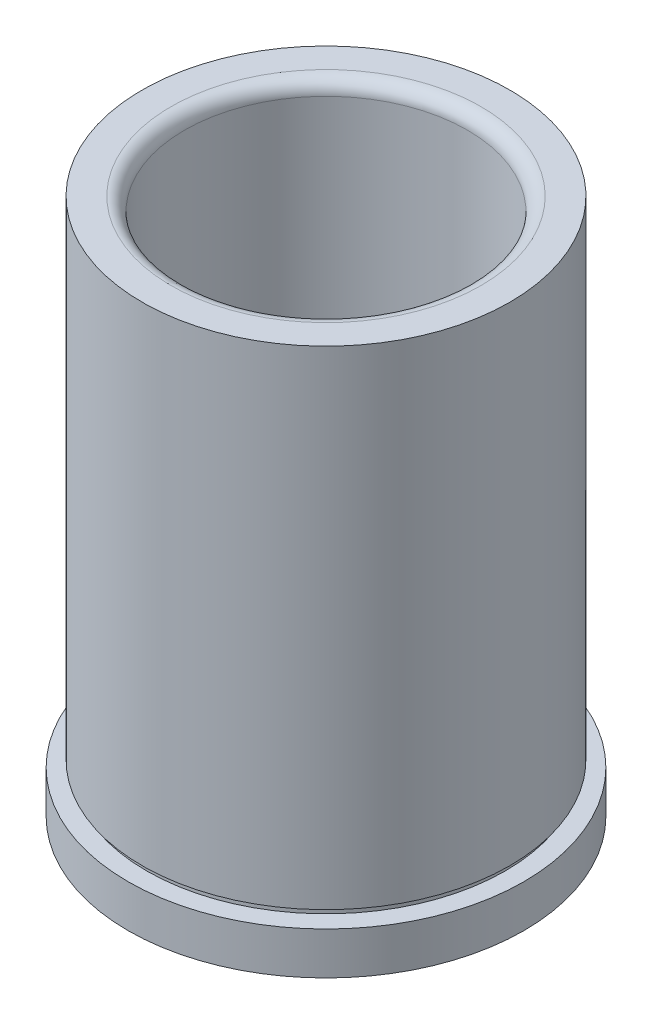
ISO-10303-21;
HEADER;
FILE_DESCRIPTION(('STEP AP214'),'2;1');
FILE_NAME('part.step','',(''),(''),'','','');
FILE_SCHEMA(('AUTOMOTIVE_DESIGN { 1 0 10303 214 1 1 1 1 }'));
ENDSEC;
DATA;
#1=APPLICATION_CONTEXT('core data for automotive mechanical design processes');
#2=APPLICATION_PROTOCOL_DEFINITION('international standard','automotive_design',2000,#1);
#3=PRODUCT_CONTEXT('',#1,'mechanical');
#4=PRODUCT('Part','Part','',(#3));
#5=PRODUCT_RELATED_PRODUCT_CATEGORY('part','',(#4));
#6=PRODUCT_DEFINITION_FORMATION('','',#4);
#7=PRODUCT_DEFINITION_CONTEXT('part definition',#1,'design');
#8=PRODUCT_DEFINITION('design','',#6,#7);
#9=PRODUCT_DEFINITION_SHAPE('','',#8);
#10=(LENGTH_UNIT() NAMED_UNIT(*) SI_UNIT(.MILLI.,.METRE.));
#11=(NAMED_UNIT(*) PLANE_ANGLE_UNIT() SI_UNIT($,.RADIAN.));
#12=(NAMED_UNIT(*) SI_UNIT($,.STERADIAN.) SOLID_ANGLE_UNIT());
#13=UNCERTAINTY_MEASURE_WITH_UNIT(LENGTH_MEASURE(1.E-05),#10,'distance_accuracy_value','');
#14=(GEOMETRIC_REPRESENTATION_CONTEXT(3) GLOBAL_UNCERTAINTY_ASSIGNED_CONTEXT((#13)) GLOBAL_UNIT_ASSIGNED_CONTEXT((#10,
#11,#12)) REPRESENTATION_CONTEXT('',''));
#15=CARTESIAN_POINT('',(0.,0.,0.));
#16=DIRECTION('',(0.,0.,1.));
#17=DIRECTION('',(1.,0.,0.));
#18=AXIS2_PLACEMENT_3D('',#15,#16,#17);
#19=CARTESIAN_POINT('',(-20.64385,76.2506908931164,0.));
#20=DIRECTION('',(0.,-1.,0.));
#21=DIRECTION('',(1.,0.,0.));
#22=AXIS2_PLACEMENT_3D('',#19,#20,#21);
#23=PLANE('',#22);
#24=CARTESIAN_POINT('',(-2.66228018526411E-13,76.2506908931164,0.));
#25=DIRECTION('',(0.,-1.,0.));
#26=DIRECTION('',(1.,0.,0.));
#27=AXIS2_PLACEMENT_3D('',#24,#25,#26);
#28=CIRCLE('',#27,17.4053499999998);
#29=CARTESIAN_POINT('',(17.4053499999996,76.2506908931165,0.));
#30=VERTEX_POINT('',#29);
#31=EDGE_CURVE('E35',#30,#30,#28,.T.);
#32=ORIENTED_EDGE('',*,*,#31,.T.);
#33=EDGE_LOOP('',(#32));
#34=FACE_BOUND('',#33,.T.);
#35=CARTESIAN_POINT('',(-2.66228018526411E-13,76.2506908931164,0.));
#36=DIRECTION('',(0.,-1.,0.));
#37=DIRECTION('',(1.,0.,0.));
#38=AXIS2_PLACEMENT_3D('',#35,#36,#37);
#39=CIRCLE('',#38,20.6438499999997);
#40=CARTESIAN_POINT('',(20.6438499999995,76.2506908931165,0.));
#41=VERTEX_POINT('',#40);
#42=EDGE_CURVE('E39',#41,#41,#39,.T.);
#43=ORIENTED_EDGE('',*,*,#42,.F.);
#44=EDGE_LOOP('',(#43));
#45=FACE_BOUND('',#44,.T.);
#46=ADVANCED_FACE('F28',(#34,#45),#23,.F.);
#47=CARTESIAN_POINT('',(3.49148336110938E-12,-1000.,0.));
#48=DIRECTION('',(0.,-1.,0.));
#49=DIRECTION('',(1.,0.,0.));
#50=AXIS2_PLACEMENT_3D('',#47,#48,#49);
#51=CYLINDRICAL_SURFACE('',#50,20.6438499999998);
#52=CARTESIAN_POINT('',(0.,21.4501908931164,0.));
#53=DIRECTION('',(0.,-1.,0.));
#54=DIRECTION('',(1.,0.,0.));
#55=AXIS2_PLACEMENT_3D('',#52,#53,#54);
#56=CIRCLE('',#55,20.6438499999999);
#57=CARTESIAN_POINT('',(20.6438499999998,21.4501908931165,0.));
#58=VERTEX_POINT('',#57);
#59=EDGE_CURVE('E43',#58,#58,#56,.T.);
#60=ORIENTED_EDGE('',*,*,#59,.F.);
#61=EDGE_LOOP('',(#60));
#62=FACE_BOUND('',#61,.T.);
#63=ORIENTED_EDGE('',*,*,#42,.T.);
#64=EDGE_LOOP('',(#63));
#65=FACE_BOUND('',#64,.T.);
#66=ADVANCED_FACE('F102',(#62,#65),#51,.T.);
#67=CARTESIAN_POINT('',(-20.64385,21.4501908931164,0.));
#68=DIRECTION('',(0.,1.,0.));
#69=DIRECTION('',(-1.,0.,0.));
#70=AXIS2_PLACEMENT_3D('',#67,#68,#69);
#71=PLANE('',#70);
#72=CARTESIAN_POINT('',(0.,21.4501908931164,0.));
#73=DIRECTION('',(0.,-1.,0.));
#74=DIRECTION('',(1.,0.,0.));
#75=AXIS2_PLACEMENT_3D('',#72,#73,#74);
#76=CIRCLE('',#75,20.1358499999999);
#77=CARTESIAN_POINT('',(20.1358499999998,21.4501908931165,0.));
#78=VERTEX_POINT('',#77);
#79=EDGE_CURVE('E48',#78,#78,#76,.T.);
#80=ORIENTED_EDGE('',*,*,#79,.F.);
#81=EDGE_LOOP('',(#80));
#82=FACE_BOUND('',#81,.T.);
#83=ORIENTED_EDGE('',*,*,#59,.T.);
#84=EDGE_LOOP('',(#83));
#85=FACE_BOUND('',#84,.T.);
#86=ADVANCED_FACE('F96',(#82,#85),#71,.F.);
#87=CARTESIAN_POINT('',(3.49148336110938E-12,-1000.,0.));
#88=DIRECTION('',(0.,-1.,0.));
#89=DIRECTION('',(1.,0.,0.));
#90=AXIS2_PLACEMENT_3D('',#87,#88,#89);
#91=CYLINDRICAL_SURFACE('',#90,20.1358499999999);
#92=CARTESIAN_POINT('',(0.,20.6881908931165,0.));
#93=DIRECTION('',(0.,-1.,0.));
#94=DIRECTION('',(1.,0.,0.));
#95=AXIS2_PLACEMENT_3D('',#92,#93,#94);
#96=CIRCLE('',#95,20.1358499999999);
#97=CARTESIAN_POINT('',(20.1358499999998,20.6881908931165,0.));
#98=VERTEX_POINT('',#97);
#99=EDGE_CURVE('E51',#98,#98,#96,.T.);
#100=ORIENTED_EDGE('',*,*,#99,.F.);
#101=EDGE_LOOP('',(#100));
#102=FACE_BOUND('',#101,.T.);
#103=ORIENTED_EDGE('',*,*,#79,.T.);
#104=EDGE_LOOP('',(#103));
#105=FACE_BOUND('',#104,.T.);
#106=ADVANCED_FACE('F90',(#102,#105),#91,.T.);
#107=CARTESIAN_POINT('',(-22.225,20.6881908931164,0.));
#108=DIRECTION('',(0.,-1.,0.));
#109=DIRECTION('',(1.,0.,0.));
#110=AXIS2_PLACEMENT_3D('',#107,#108,#109);
#111=PLANE('',#110);
#112=CARTESIAN_POINT('',(0.,20.6881908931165,0.));
#113=DIRECTION('',(0.,-1.,0.));
#114=DIRECTION('',(1.,0.,0.));
#115=AXIS2_PLACEMENT_3D('',#112,#113,#114);
#116=CIRCLE('',#115,22.2249999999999);
#117=CARTESIAN_POINT('',(22.2249999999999,20.6881908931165,0.));
#118=VERTEX_POINT('',#117);
#119=EDGE_CURVE('E54',#118,#118,#116,.T.);
#120=ORIENTED_EDGE('',*,*,#119,.F.);
#121=EDGE_LOOP('',(#120));
#122=FACE_BOUND('',#121,.T.);
#123=ORIENTED_EDGE('',*,*,#99,.T.);
#124=EDGE_LOOP('',(#123));
#125=FACE_BOUND('',#124,.T.);
#126=ADVANCED_FACE('F84',(#122,#125),#111,.F.);
#127=CARTESIAN_POINT('',(3.49148336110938E-12,-1000.,0.));
#128=DIRECTION('',(0.,-1.,0.));
#129=DIRECTION('',(1.,0.,0.));
#130=AXIS2_PLACEMENT_3D('',#127,#128,#129);
#131=CYLINDRICAL_SURFACE('',#130,22.2249999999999);
#132=CARTESIAN_POINT('',(0.,15.9256908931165,0.));
#133=DIRECTION('',(0.,-1.,0.));
#134=DIRECTION('',(1.,0.,0.));
#135=AXIS2_PLACEMENT_3D('',#132,#133,#134);
#136=CIRCLE('',#135,22.2249999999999);
#137=CARTESIAN_POINT('',(22.2249999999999,15.9256908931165,0.));
#138=VERTEX_POINT('',#137);
#139=EDGE_CURVE('E57',#138,#138,#136,.T.);
#140=ORIENTED_EDGE('',*,*,#139,.F.);
#141=EDGE_LOOP('',(#140));
#142=FACE_BOUND('',#141,.T.);
#143=ORIENTED_EDGE('',*,*,#119,.T.);
#144=EDGE_LOOP('',(#143));
#145=FACE_BOUND('',#144,.T.);
#146=ADVANCED_FACE('F78',(#142,#145),#131,.T.);
#147=CARTESIAN_POINT('',(-16.6974055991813,15.9256908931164,0.));
#148=DIRECTION('',(0.,1.,0.));
#149=DIRECTION('',(-1.,0.,0.));
#150=AXIS2_PLACEMENT_3D('',#147,#148,#149);
#151=PLANE('',#150);
#152=CARTESIAN_POINT('',(0.,15.9256908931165,0.));
#153=DIRECTION('',(0.,-1.,0.));
#154=DIRECTION('',(1.,0.,0.));
#155=AXIS2_PLACEMENT_3D('',#152,#153,#154);
#156=CIRCLE('',#155,16.6974055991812);
#157=CARTESIAN_POINT('',(16.6974055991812,15.9256908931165,0.));
#158=VERTEX_POINT('',#157);
#159=EDGE_CURVE('E60',#158,#158,#156,.T.);
#160=ORIENTED_EDGE('',*,*,#159,.F.);
#161=EDGE_LOOP('',(#160));
#162=FACE_BOUND('',#161,.T.);
#163=ORIENTED_EDGE('',*,*,#139,.T.);
#164=EDGE_LOOP('',(#163));
#165=FACE_BOUND('',#164,.T.);
#166=ADVANCED_FACE('F72',(#162,#165),#151,.F.);
#167=CARTESIAN_POINT('',(0.,15.9256908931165,0.));
#168=DIRECTION('',(0.,-1.,0.));
#169=DIRECTION('',(1.,0.,0.));
#170=AXIS2_PLACEMENT_3D('',#167,#168,#169);
#171=CONICAL_SURFACE('',#170,16.6974055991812,0.785398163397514);
#172=CARTESIAN_POINT('',(0.,16.7417464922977,0.));
#173=DIRECTION('',(0.,-1.,0.));
#174=DIRECTION('',(1.,0.,0.));
#175=AXIS2_PLACEMENT_3D('',#172,#173,#174);
#176=CIRCLE('',#175,15.8813499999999);
#177=CARTESIAN_POINT('',(15.8813499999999,16.7417464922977,0.));
#178=VERTEX_POINT('',#177);
#179=EDGE_CURVE('E63',#178,#178,#176,.T.);
#180=ORIENTED_EDGE('',*,*,#179,.F.);
#181=EDGE_LOOP('',(#180));
#182=FACE_BOUND('',#181,.T.);
#183=ORIENTED_EDGE('',*,*,#159,.T.);
#184=EDGE_LOOP('',(#183));
#185=FACE_BOUND('',#184,.T.);
#186=ADVANCED_FACE('F69',(#182,#185),#171,.F.);
#187=CARTESIAN_POINT('',(3.49148336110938E-12,-1000.,0.));
#188=DIRECTION('',(0.,-1.,0.));
#189=DIRECTION('',(1.,0.,0.));
#190=AXIS2_PLACEMENT_3D('',#187,#188,#189);
#191=CYLINDRICAL_SURFACE('',#190,15.8813499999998);
#192=CARTESIAN_POINT('',(-2.6090699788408E-13,74.7266908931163,0.));
#193=DIRECTION('',(0.,-1.,0.));
#194=DIRECTION('',(1.,0.,0.));
#195=AXIS2_PLACEMENT_3D('',#192,#193,#194);
#196=CIRCLE('',#195,15.8813499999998);
#197=CARTESIAN_POINT('',(15.8813499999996,74.7266908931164,0.));
#198=VERTEX_POINT('',#197);
#199=EDGE_CURVE('E10',#198,#198,#196,.F.);
#200=ORIENTED_EDGE('',*,*,#199,.T.);
#201=EDGE_LOOP('',(#200));
#202=FACE_BOUND('',#201,.T.);
#203=ORIENTED_EDGE('',*,*,#179,.T.);
#204=EDGE_LOOP('',(#203));
#205=FACE_BOUND('',#204,.T.);
#206=ADVANCED_FACE('F67',(#202,#205),#191,.F.);
#207=CARTESIAN_POINT('',(-2.6090699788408E-13,74.7266908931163,0.));
#208=DIRECTION('',(0.,-1.,0.));
#209=DIRECTION('',(1.,0.,0.));
#210=AXIS2_PLACEMENT_3D('',#207,#208,#209);
#211=TOROIDAL_SURFACE('',#210,17.4053499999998,1.524);
#212=ORIENTED_EDGE('',*,*,#199,.F.);
#213=EDGE_LOOP('',(#212));
#214=FACE_BOUND('',#213,.T.);
#215=ORIENTED_EDGE('',*,*,#31,.F.);
#216=EDGE_LOOP('',(#215));
#217=FACE_BOUND('',#216,.T.);
#218=ADVANCED_FACE('F30',(#214,#217),#211,.T.);
#219=CLOSED_SHELL('',(#46,#66,#86,#106,#126,#146,#166,#186,#206,#218));
#220=MANIFOLD_SOLID_BREP('B2',#219);
#221=ADVANCED_BREP_SHAPE_REPRESENTATION('',(#18,#220),#14);
#222=SHAPE_DEFINITION_REPRESENTATION(#9,#221);
ENDSEC;
END-ISO-10303-21;
